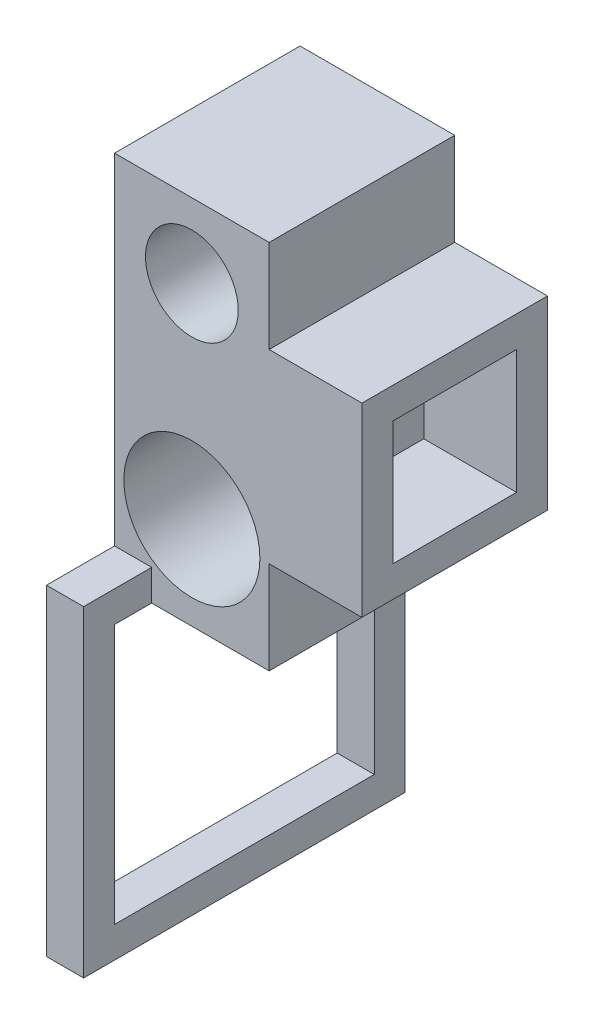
from build123d import *

# Parameters (mm, degrees)
SKETCH1_W           = 25
SKETCH1_H           = 60
SKETCH1_R           = 7.5
SKETCH1_R_2         = 11
BOSS_EXTRUDE1_DEPTH = 15
SKETCH2_W           = 30
SKETCH2_H           = 30
SKETCH2_W_2         = 20
SKETCH2_H_2         = 20
BOSS_EXTRUDE2_DEPTH = 15
SKETCH6_W           = 52
SKETCH6_H           = 52
SKETCH6_W_2         = 42
SKETCH6_H_2         = 42
BOSS_EXTRUDE4_DEPTH = 6


with BuildPart() as part:
    # Sketch1 → Boss-Extrude1 (new, symmetric)
    with BuildSketch(Plane.XY):
        Rectangle(SKETCH1_W, SKETCH1_H)
        with Locations((0, 18)):
            Circle(SKETCH1_R, mode=Mode.SUBTRACT)
        with Locations((0, -15)):
            Circle(SKETCH1_R_2, mode=Mode.SUBTRACT)
    extrude(amount=BOSS_EXTRUDE1_DEPTH, both=True)

    # Sketch2 → Boss-Extrude2 (add)
    with BuildSketch(Plane(origin=(12.5, 0, 0), x_dir=(0, 0, -1), z_dir=(1, 0, 0))):
        Rectangle(SKETCH2_W, SKETCH2_H)
        Rectangle(SKETCH2_W_2, SKETCH2_H_2, mode=Mode.SUBTRACT)
    extrude(amount=BOSS_EXTRUDE2_DEPTH)

    # Sketch6 → Boss-Extrude4 (add)
    with BuildSketch(Plane.ZY.offset(12.5)):
        with Locations((0, -51)):
            Rectangle(SKETCH6_W, SKETCH6_H)
        with Locations((0, -51)):
            Rectangle(SKETCH6_W_2, SKETCH6_H_2, mode=Mode.SUBTRACT)
    extrude(amount=-BOSS_EXTRUDE4_DEPTH)


solid = part.part
